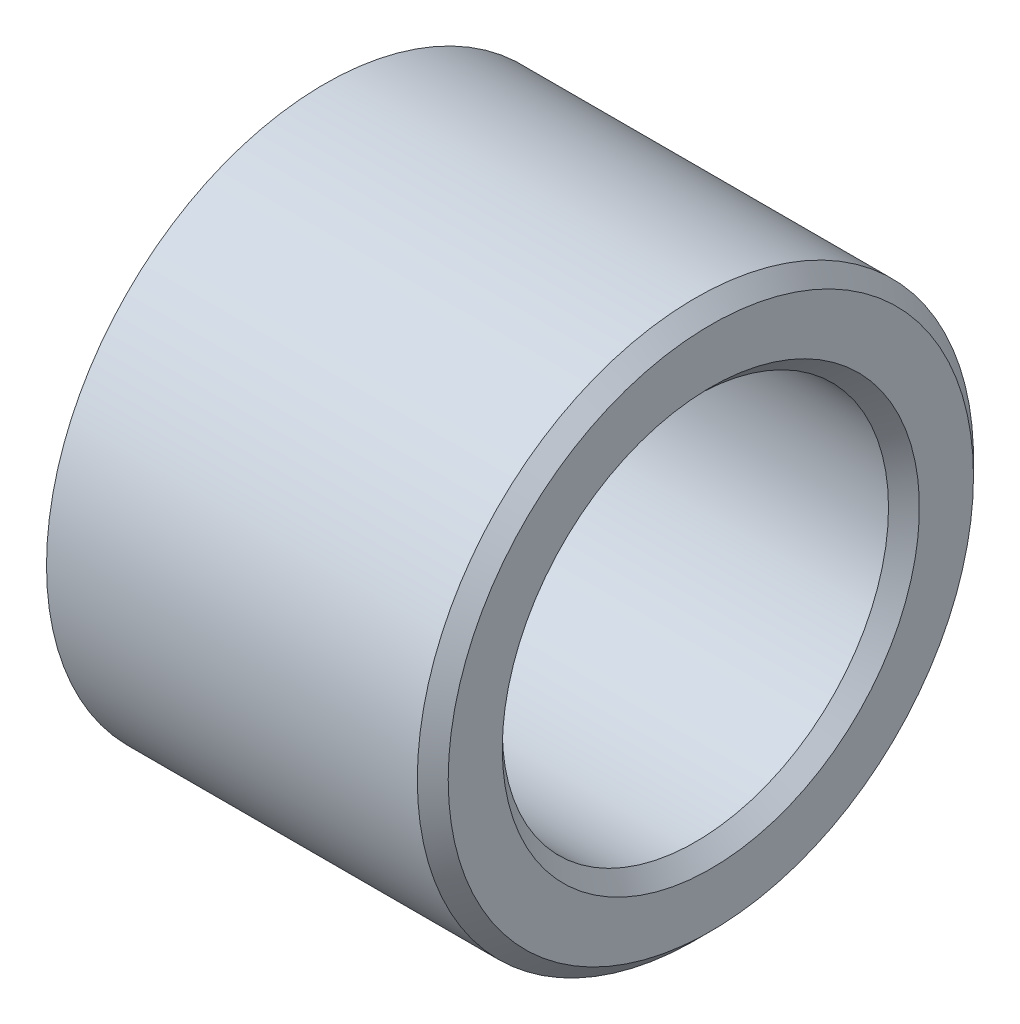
ISO-10303-21;
HEADER;
FILE_DESCRIPTION(('STEP AP214'),'2;1');
FILE_NAME('part.step','',(''),(''),'','','');
FILE_SCHEMA(('AUTOMOTIVE_DESIGN { 1 0 10303 214 1 1 1 1 }'));
ENDSEC;
DATA;
#1=APPLICATION_CONTEXT('core data for automotive mechanical design processes');
#2=APPLICATION_PROTOCOL_DEFINITION('international standard','automotive_design',2000,#1);
#3=PRODUCT_CONTEXT('',#1,'mechanical');
#4=PRODUCT('Part','Part','',(#3));
#5=PRODUCT_RELATED_PRODUCT_CATEGORY('part','',(#4));
#6=PRODUCT_DEFINITION_FORMATION('','',#4);
#7=PRODUCT_DEFINITION_CONTEXT('part definition',#1,'design');
#8=PRODUCT_DEFINITION('design','',#6,#7);
#9=PRODUCT_DEFINITION_SHAPE('','',#8);
#10=(LENGTH_UNIT() NAMED_UNIT(*) SI_UNIT(.MILLI.,.METRE.));
#11=(NAMED_UNIT(*) PLANE_ANGLE_UNIT() SI_UNIT($,.RADIAN.));
#12=(NAMED_UNIT(*) SI_UNIT($,.STERADIAN.) SOLID_ANGLE_UNIT());
#13=UNCERTAINTY_MEASURE_WITH_UNIT(LENGTH_MEASURE(1.E-05),#10,'distance_accuracy_value','');
#14=(GEOMETRIC_REPRESENTATION_CONTEXT(3) GLOBAL_UNCERTAINTY_ASSIGNED_CONTEXT((#13)) GLOBAL_UNIT_ASSIGNED_CONTEXT((#10,
#11,#12)) REPRESENTATION_CONTEXT('',''));
#15=CARTESIAN_POINT('',(0.,0.,0.));
#16=DIRECTION('',(0.,0.,1.));
#17=DIRECTION('',(1.,0.,0.));
#18=AXIS2_PLACEMENT_3D('',#15,#16,#17);
#19=CARTESIAN_POINT('',(50.,36.,0.));
#20=DIRECTION('',(-1.,0.,0.));
#21=DIRECTION('',(0.,0.,1.));
#22=AXIS2_PLACEMENT_3D('',#19,#20,#21);
#23=PLANE('',#22);
#24=CARTESIAN_POINT('',(50.,0.,0.));
#25=DIRECTION('',(-1.,0.,0.));
#26=DIRECTION('',(0.,0.,1.));
#27=AXIS2_PLACEMENT_3D('',#24,#25,#26);
#28=CIRCLE('',#27,27.);
#29=CARTESIAN_POINT('',(50.,0.,27.));
#30=VERTEX_POINT('',#29);
#31=EDGE_CURVE('E48',#30,#30,#28,.T.);
#32=ORIENTED_EDGE('',*,*,#31,.T.);
#33=EDGE_LOOP('',(#32));
#34=FACE_BOUND('',#33,.T.);
#35=CARTESIAN_POINT('',(50.,0.,0.));
#36=DIRECTION('',(-1.,0.,0.));
#37=DIRECTION('',(0.,0.,1.));
#38=AXIS2_PLACEMENT_3D('',#35,#36,#37);
#39=CIRCLE('',#38,34.);
#40=CARTESIAN_POINT('',(50.,0.,34.));
#41=VERTEX_POINT('',#40);
#42=EDGE_CURVE('E51',#41,#41,#39,.F.);
#43=ORIENTED_EDGE('',*,*,#42,.T.);
#44=EDGE_LOOP('',(#43));
#45=FACE_BOUND('',#44,.T.);
#46=ADVANCED_FACE('F29',(#34,#45),#23,.F.);
#47=CARTESIAN_POINT('',(-5.54365079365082,0.,0.));
#48=DIRECTION('',(-1.,0.,0.));
#49=DIRECTION('',(0.,0.,1.));
#50=AXIS2_PLACEMENT_3D('',#47,#48,#49);
#51=CYLINDRICAL_SURFACE('',#50,36.);
#52=CARTESIAN_POINT('',(48.,0.,0.));
#53=DIRECTION('',(-1.,0.,0.));
#54=DIRECTION('',(0.,0.,1.));
#55=AXIS2_PLACEMENT_3D('',#52,#53,#54);
#56=CIRCLE('',#55,36.);
#57=CARTESIAN_POINT('',(48.,0.,36.));
#58=VERTEX_POINT('',#57);
#59=EDGE_CURVE('E10',#58,#58,#56,.T.);
#60=ORIENTED_EDGE('',*,*,#59,.T.);
#61=EDGE_LOOP('',(#60));
#62=FACE_BOUND('',#61,.T.);
#63=CARTESIAN_POINT('',(0.,0.,0.));
#64=DIRECTION('',(-1.,0.,0.));
#65=DIRECTION('',(0.,0.,1.));
#66=AXIS2_PLACEMENT_3D('',#63,#64,#65);
#67=CIRCLE('',#66,36.);
#68=CARTESIAN_POINT('',(0.,0.,36.));
#69=VERTEX_POINT('',#68);
#70=EDGE_CURVE('E54',#69,#69,#67,.T.);
#71=ORIENTED_EDGE('',*,*,#70,.F.);
#72=EDGE_LOOP('',(#71));
#73=FACE_BOUND('',#72,.T.);
#74=ADVANCED_FACE('F60',(#62,#73),#51,.T.);
#75=CARTESIAN_POINT('',(0.,25.,0.));
#76=DIRECTION('',(1.,0.,0.));
#77=DIRECTION('',(0.,0.,-1.));
#78=AXIS2_PLACEMENT_3D('',#75,#76,#77);
#79=PLANE('',#78);
#80=CARTESIAN_POINT('',(0.,0.,0.));
#81=DIRECTION('',(1.,0.,0.));
#82=DIRECTION('',(0.,0.,-1.));
#83=AXIS2_PLACEMENT_3D('',#80,#81,#82);
#84=CIRCLE('',#83,27.);
#85=CARTESIAN_POINT('',(0.,0.,-27.));
#86=VERTEX_POINT('',#85);
#87=EDGE_CURVE('E35',#86,#86,#84,.T.);
#88=ORIENTED_EDGE('',*,*,#87,.T.);
#89=EDGE_LOOP('',(#88));
#90=FACE_BOUND('',#89,.T.);
#91=ORIENTED_EDGE('',*,*,#70,.T.);
#92=EDGE_LOOP('',(#91));
#93=FACE_BOUND('',#92,.T.);
#94=ADVANCED_FACE('F58',(#90,#93),#79,.F.);
#95=CARTESIAN_POINT('',(-5.54365079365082,0.,0.));
#96=DIRECTION('',(-1.,0.,0.));
#97=DIRECTION('',(0.,0.,1.));
#98=AXIS2_PLACEMENT_3D('',#95,#96,#97);
#99=CYLINDRICAL_SURFACE('',#98,25.);
#100=CARTESIAN_POINT('',(48.,0.,0.));
#101=DIRECTION('',(-1.,0.,0.));
#102=DIRECTION('',(0.,0.,1.));
#103=AXIS2_PLACEMENT_3D('',#100,#101,#102);
#104=CIRCLE('',#103,25.);
#105=CARTESIAN_POINT('',(48.,0.,25.));
#106=VERTEX_POINT('',#105);
#107=EDGE_CURVE('E39',#106,#106,#104,.F.);
#108=ORIENTED_EDGE('',*,*,#107,.T.);
#109=EDGE_LOOP('',(#108));
#110=FACE_BOUND('',#109,.T.);
#111=CARTESIAN_POINT('',(2.,0.,0.));
#112=DIRECTION('',(1.,0.,0.));
#113=DIRECTION('',(0.,0.,-1.));
#114=AXIS2_PLACEMENT_3D('',#111,#112,#113);
#115=CIRCLE('',#114,25.);
#116=CARTESIAN_POINT('',(2.,0.,-25.));
#117=VERTEX_POINT('',#116);
#118=EDGE_CURVE('E43',#117,#117,#115,.F.);
#119=ORIENTED_EDGE('',*,*,#118,.T.);
#120=EDGE_LOOP('',(#119));
#121=FACE_BOUND('',#120,.T.);
#122=ADVANCED_FACE('F66',(#110,#121),#99,.F.);
#123=CARTESIAN_POINT('',(50.,0.,0.));
#124=DIRECTION('',(1.,0.,0.));
#125=DIRECTION('',(0.,0.,-1.));
#126=AXIS2_PLACEMENT_3D('',#123,#124,#125);
#127=CONICAL_SURFACE('',#126,27.,0.785398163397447);
#128=ORIENTED_EDGE('',*,*,#107,.F.);
#129=EDGE_LOOP('',(#128));
#130=FACE_BOUND('',#129,.T.);
#131=ORIENTED_EDGE('',*,*,#31,.F.);
#132=EDGE_LOOP('',(#131));
#133=FACE_BOUND('',#132,.T.);
#134=ADVANCED_FACE('F72',(#130,#133),#127,.F.);
#135=CARTESIAN_POINT('',(2.,0.,0.));
#136=DIRECTION('',(-1.,0.,0.));
#137=DIRECTION('',(0.,0.,1.));
#138=AXIS2_PLACEMENT_3D('',#135,#136,#137);
#139=CONICAL_SURFACE('',#138,25.,0.78539816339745);
#140=ORIENTED_EDGE('',*,*,#87,.F.);
#141=EDGE_LOOP('',(#140));
#142=FACE_BOUND('',#141,.T.);
#143=ORIENTED_EDGE('',*,*,#118,.F.);
#144=EDGE_LOOP('',(#143));
#145=FACE_BOUND('',#144,.T.);
#146=ADVANCED_FACE('F76',(#142,#145),#139,.F.);
#147=CARTESIAN_POINT('',(48.,0.,0.));
#148=DIRECTION('',(-1.,0.,0.));
#149=DIRECTION('',(0.,0.,1.));
#150=AXIS2_PLACEMENT_3D('',#147,#148,#149);
#151=CONICAL_SURFACE('',#150,36.,0.78539816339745);
#152=ORIENTED_EDGE('',*,*,#42,.F.);
#153=EDGE_LOOP('',(#152));
#154=FACE_BOUND('',#153,.T.);
#155=ORIENTED_EDGE('',*,*,#59,.F.);
#156=EDGE_LOOP('',(#155));
#157=FACE_BOUND('',#156,.T.);
#158=ADVANCED_FACE('F80',(#154,#157),#151,.T.);
#159=CLOSED_SHELL('',(#46,#74,#94,#122,#134,#146,#158));
#160=MANIFOLD_SOLID_BREP('B2',#159);
#161=ADVANCED_BREP_SHAPE_REPRESENTATION('',(#18,#160),#14);
#162=SHAPE_DEFINITION_REPRESENTATION(#9,#161);
ENDSEC;
END-ISO-10303-21;
